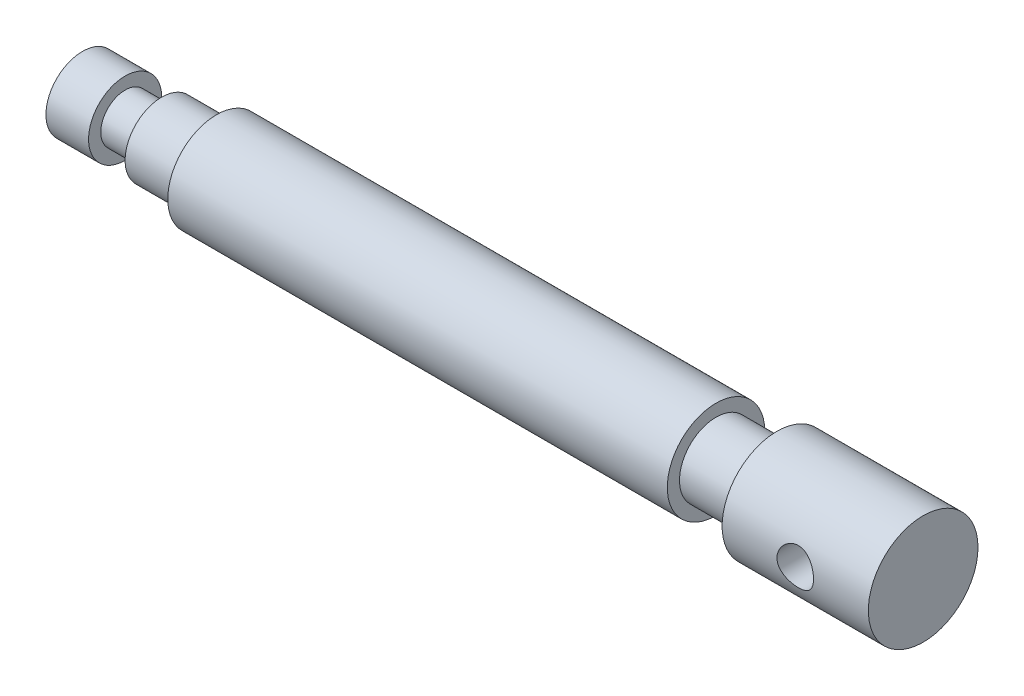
from build123d import *

# Parameters (mm, degrees)
SKETCH2_R          = 3
CUT_EXTRUDE1_DEPTH = 10


with BuildPart() as part:
    # Sketch1 → Revolve1 (revolve)
    with BuildSketch(Plane.XY, mode=Mode.PRIVATE) as revolve1_sk:
        Polygon((0, 0), (0, 6), (7, 6), (7, 4), (13, 4), (13, 6), (22, 6), (22, 8), (104, 8), (104, 6), (114, 6), (114, 9), (138, 9), (138, 0), align=None)
    revolve(revolve1_sk.sketch.rotate(Axis((0, 0, 0), (-1, 0, 0)), 90), axis=Axis((0, 0, 0), (-1, 0, 0)))

    # Sketch2 → Cut-Extrude1 (cut, symmetric)
    with BuildSketch(Plane.XY):
        with Locations((126, 0)):
            Circle(SKETCH2_R)
    extrude(amount=CUT_EXTRUDE1_DEPTH, both=True, mode=Mode.SUBTRACT)


solid = part.part
